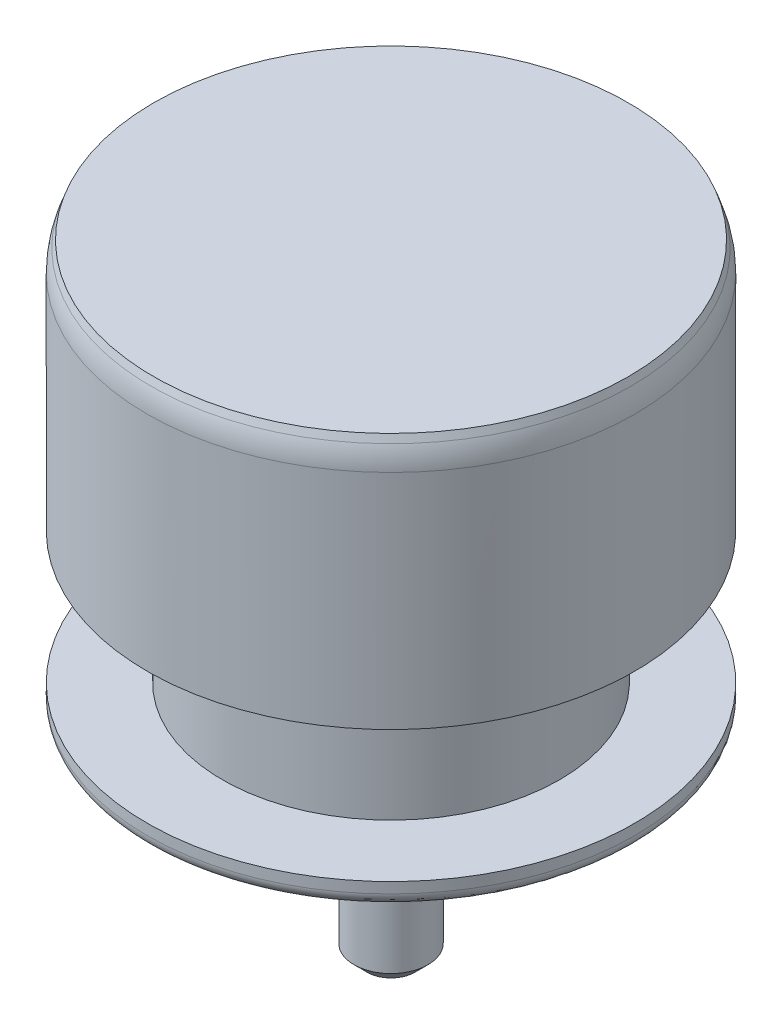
ISO-10303-21;
HEADER;
FILE_DESCRIPTION(('STEP AP214'),'2;1');
FILE_NAME('part.step','',(''),(''),'','','');
FILE_SCHEMA(('AUTOMOTIVE_DESIGN { 1 0 10303 214 1 1 1 1 }'));
ENDSEC;
DATA;
#1=APPLICATION_CONTEXT('core data for automotive mechanical design processes');
#2=APPLICATION_PROTOCOL_DEFINITION('international standard','automotive_design',2000,#1);
#3=PRODUCT_CONTEXT('',#1,'mechanical');
#4=PRODUCT('Part','Part','',(#3));
#5=PRODUCT_RELATED_PRODUCT_CATEGORY('part','',(#4));
#6=PRODUCT_DEFINITION_FORMATION('','',#4);
#7=PRODUCT_DEFINITION_CONTEXT('part definition',#1,'design');
#8=PRODUCT_DEFINITION('design','',#6,#7);
#9=PRODUCT_DEFINITION_SHAPE('','',#8);
#10=(LENGTH_UNIT() NAMED_UNIT(*) SI_UNIT(.MILLI.,.METRE.));
#11=(NAMED_UNIT(*) PLANE_ANGLE_UNIT() SI_UNIT($,.RADIAN.));
#12=(NAMED_UNIT(*) SI_UNIT($,.STERADIAN.) SOLID_ANGLE_UNIT());
#13=UNCERTAINTY_MEASURE_WITH_UNIT(LENGTH_MEASURE(1.E-05),#10,'distance_accuracy_value','');
#14=(GEOMETRIC_REPRESENTATION_CONTEXT(3) GLOBAL_UNCERTAINTY_ASSIGNED_CONTEXT((#13)) GLOBAL_UNIT_ASSIGNED_CONTEXT((#10,
#11,#12)) REPRESENTATION_CONTEXT('',''));
#15=CARTESIAN_POINT('',(0.,0.,0.));
#16=DIRECTION('',(0.,0.,1.));
#17=DIRECTION('',(1.,0.,0.));
#18=AXIS2_PLACEMENT_3D('',#15,#16,#17);
#19=CARTESIAN_POINT('',(3.66,0.,0.));
#20=DIRECTION('',(0.,-1.,0.));
#21=DIRECTION('',(1.,0.,0.));
#22=AXIS2_PLACEMENT_3D('',#19,#20,#21);
#23=PLANE('',#22);
#24=CARTESIAN_POINT('',(0.,0.,0.));
#25=DIRECTION('',(0.,1.,0.));
#26=DIRECTION('',(-1.,0.,0.));
#27=AXIS2_PLACEMENT_3D('',#24,#25,#26);
#28=CIRCLE('',#27,3.66);
#29=CARTESIAN_POINT('',(-3.66,0.,0.));
#30=VERTEX_POINT('',#29);
#31=EDGE_CURVE('E105',#30,#30,#28,.T.);
#32=ORIENTED_EDGE('',*,*,#31,.T.);
#33=EDGE_LOOP('',(#32));
#34=FACE_BOUND('',#33,.T.);
#35=ADVANCED_FACE('F64',(#34),#23,.F.);
#36=CARTESIAN_POINT('',(0.570000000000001,-9.6,0.));
#37=DIRECTION('',(0.,1.,0.));
#38=DIRECTION('',(-1.,0.,0.));
#39=AXIS2_PLACEMENT_3D('',#36,#37,#38);
#40=PLANE('',#39);
#41=CARTESIAN_POINT('',(0.,-9.6,0.));
#42=DIRECTION('',(0.,1.,0.));
#43=DIRECTION('',(-1.,0.,0.));
#44=AXIS2_PLACEMENT_3D('',#41,#42,#43);
#45=CIRCLE('',#44,0.369999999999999);
#46=CARTESIAN_POINT('',(-0.369999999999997,-9.6,0.));
#47=VERTEX_POINT('',#46);
#48=EDGE_CURVE('E11',#47,#47,#45,.F.);
#49=ORIENTED_EDGE('',*,*,#48,.T.);
#50=EDGE_LOOP('',(#49));
#51=FACE_BOUND('',#50,.T.);
#52=ADVANCED_FACE('F127',(#51),#40,.F.);
#53=CARTESIAN_POINT('',(0.,0.,0.));
#54=DIRECTION('',(0.,1.,0.));
#55=DIRECTION('',(-1.,0.,0.));
#56=AXIS2_PLACEMENT_3D('',#53,#54,#55);
#57=CYLINDRICAL_SURFACE('',#56,0.57);
#58=CARTESIAN_POINT('',(0.,-9.4,0.));
#59=DIRECTION('',(0.,1.,0.));
#60=DIRECTION('',(-1.,0.,0.));
#61=AXIS2_PLACEMENT_3D('',#58,#59,#60);
#62=CIRCLE('',#61,0.57);
#63=CARTESIAN_POINT('',(-0.569999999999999,-9.4,0.));
#64=VERTEX_POINT('',#63);
#65=EDGE_CURVE('E71',#64,#64,#62,.T.);
#66=ORIENTED_EDGE('',*,*,#65,.T.);
#67=EDGE_LOOP('',(#66));
#68=FACE_BOUND('',#67,.T.);
#69=CARTESIAN_POINT('',(0.,-7.89692562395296,0.));
#70=DIRECTION('',(0.,1.,0.));
#71=DIRECTION('',(-1.,0.,0.));
#72=AXIS2_PLACEMENT_3D('',#69,#70,#71);
#73=CIRCLE('',#72,0.57);
#74=CARTESIAN_POINT('',(-0.569999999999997,-7.89692562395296,0.));
#75=VERTEX_POINT('',#74);
#76=EDGE_CURVE('E90',#75,#75,#73,.T.);
#77=ORIENTED_EDGE('',*,*,#76,.F.);
#78=EDGE_LOOP('',(#77));
#79=FACE_BOUND('',#78,.T.);
#80=ADVANCED_FACE('F132',(#68,#79),#57,.T.);
#81=CARTESIAN_POINT('',(0.,-7.89692562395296,0.));
#82=DIRECTION('',(0.,1.,0.));
#83=DIRECTION('',(-1.,0.,0.));
#84=AXIS2_PLACEMENT_3D('',#81,#82,#83);
#85=CONICAL_SURFACE('',#84,0.57,1.08210413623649);
#86=CARTESIAN_POINT('',(0.,-6.25718993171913,0.));
#87=DIRECTION('',(0.,-1.,0.));
#88=DIRECTION('',(1.,0.,0.));
#89=AXIS2_PLACEMENT_3D('',#86,#87,#88);
#90=CIRCLE('',#89,3.65389431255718);
#91=CARTESIAN_POINT('',(-3.65389431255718,-6.25718993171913,0.));
#92=VERTEX_POINT('',#91);
#93=EDGE_CURVE('E84',#92,#92,#90,.T.);
#94=CARTESIAN_POINT('',(-3.65389431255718,-6.25718993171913,0.));
#95=CARTESIAN_POINT('',(-3.62177041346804,-6.27427051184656,0.));
#96=CARTESIAN_POINT('',(-3.5896465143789,-6.291351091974,0.));
#97=CARTESIAN_POINT('',(-3.52539871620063,-6.32551225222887,0.));
#98=CARTESIAN_POINT('',(-3.49327481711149,-6.34259283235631,0.));
#99=CARTESIAN_POINT('',(-3.42902701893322,-6.37675399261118,0.));
#100=CARTESIAN_POINT('',(-3.39690311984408,-6.39383457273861,0.));
#101=CARTESIAN_POINT('',(-3.3326553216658,-6.42799573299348,0.));
#102=CARTESIAN_POINT('',(-3.30053142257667,-6.44507631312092,0.));
#103=CARTESIAN_POINT('',(-3.23628362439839,-6.47923747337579,0.));
#104=CARTESIAN_POINT('',(-3.20415972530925,-6.49631805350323,0.));
#105=CARTESIAN_POINT('',(-3.13991192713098,-6.5304792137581,0.));
#106=CARTESIAN_POINT('',(-3.10778802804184,-6.54755979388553,0.));
#107=CARTESIAN_POINT('',(-3.04354022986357,-6.58172095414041,0.));
#108=CARTESIAN_POINT('',(-3.01141633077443,-6.59880153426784,0.));
#109=CARTESIAN_POINT('',(-2.94716853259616,-6.63296269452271,0.));
#110=CARTESIAN_POINT('',(-2.91504463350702,-6.65004327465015,0.));
#111=CARTESIAN_POINT('',(-2.85079683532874,-6.68420443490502,0.));
#112=CARTESIAN_POINT('',(-2.81867293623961,-6.70128501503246,0.));
#113=CARTESIAN_POINT('',(-2.75442513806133,-6.73544617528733,0.));
#114=CARTESIAN_POINT('',(-2.72230123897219,-6.75252675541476,0.));
#115=CARTESIAN_POINT('',(-2.65805344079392,-6.78668791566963,0.));
#116=CARTESIAN_POINT('',(-2.62592954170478,-6.80376849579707,0.));
#117=CARTESIAN_POINT('',(-2.56168174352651,-6.83792965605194,0.));
#118=CARTESIAN_POINT('',(-2.52955784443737,-6.85501023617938,0.));
#119=CARTESIAN_POINT('',(-2.4653100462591,-6.88917139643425,0.));
#120=CARTESIAN_POINT('',(-2.43318614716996,-6.90625197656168,0.));
#121=CARTESIAN_POINT('',(-2.36893834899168,-6.94041313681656,0.));
#122=CARTESIAN_POINT('',(-2.33681444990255,-6.95749371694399,0.));
#123=CARTESIAN_POINT('',(-2.27256665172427,-6.99165487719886,0.));
#124=CARTESIAN_POINT('',(-2.24044275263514,-7.0087354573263,0.));
#125=CARTESIAN_POINT('',(-2.17619495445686,-7.04289661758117,0.));
#126=CARTESIAN_POINT('',(-2.14407105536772,-7.05997719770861,0.));
#127=CARTESIAN_POINT('',(-2.07982325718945,-7.09413835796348,0.));
#128=CARTESIAN_POINT('',(-2.04769935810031,-7.11121893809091,0.));
#129=CARTESIAN_POINT('',(-1.98345155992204,-7.14538009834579,0.));
#130=CARTESIAN_POINT('',(-1.9513276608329,-7.16246067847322,0.));
#131=CARTESIAN_POINT('',(-1.88707986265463,-7.19662183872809,0.));
#132=CARTESIAN_POINT('',(-1.85495596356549,-7.21370241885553,0.));
#133=CARTESIAN_POINT('',(-1.79070816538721,-7.2478635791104,0.));
#134=CARTESIAN_POINT('',(-1.75858426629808,-7.26494415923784,0.));
#135=CARTESIAN_POINT('',(-1.6943364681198,-7.29910531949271,0.));
#136=CARTESIAN_POINT('',(-1.66221256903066,-7.31618589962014,0.));
#137=CARTESIAN_POINT('',(-1.59796477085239,-7.35034705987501,0.));
#138=CARTESIAN_POINT('',(-1.56584087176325,-7.36742764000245,0.));
#139=CARTESIAN_POINT('',(-1.50159307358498,-7.40158880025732,0.));
#140=CARTESIAN_POINT('',(-1.46946917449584,-7.41866938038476,0.));
#141=CARTESIAN_POINT('',(-1.40522137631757,-7.45283054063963,0.));
#142=CARTESIAN_POINT('',(-1.37309747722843,-7.46991112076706,0.));
#143=CARTESIAN_POINT('',(-1.30884967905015,-7.50407228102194,0.));
#144=CARTESIAN_POINT('',(-1.27672577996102,-7.52115286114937,0.));
#145=CARTESIAN_POINT('',(-1.21247798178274,-7.55531402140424,0.));
#146=CARTESIAN_POINT('',(-1.18035408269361,-7.57239460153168,0.));
#147=CARTESIAN_POINT('',(-1.11610628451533,-7.60655576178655,0.));
#148=CARTESIAN_POINT('',(-1.08398238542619,-7.62363634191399,0.));
#149=CARTESIAN_POINT('',(-1.01973458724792,-7.65779750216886,0.));
#150=CARTESIAN_POINT('',(-0.987610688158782,-7.67487808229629,0.));
#151=CARTESIAN_POINT('',(-0.923362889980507,-7.70903924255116,0.));
#152=CARTESIAN_POINT('',(-0.89123899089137,-7.7261198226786,0.));
#153=CARTESIAN_POINT('',(-0.826991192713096,-7.76028098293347,0.));
#154=CARTESIAN_POINT('',(-0.794867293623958,-7.77736156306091,0.));
#155=CARTESIAN_POINT('',(-0.730619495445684,-7.81152272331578,0.));
#156=CARTESIAN_POINT('',(-0.698495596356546,-7.82860330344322,0.));
#157=CARTESIAN_POINT('',(-0.634247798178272,-7.86276446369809,0.));
#158=CARTESIAN_POINT('',(-0.602123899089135,-7.87984504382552,0.));
#159=CARTESIAN_POINT('',(-0.569999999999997,-7.89692562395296,0.));
#160=B_SPLINE_CURVE_WITH_KNOTS('',3,(#94,#95,#96,#97,#98,#99,#100,#101,#102,#103,#104,#105,#106,
#107,#108,#109,#110,#111,#112,#113,#114,#115,#116,#117,#118,#119,#120,#121,#122,#123,#124,#125,
#126,#127,#128,#129,#130,#131,#132,#133,#134,#135,#136,#137,#138,#139,#140,#141,#142,#143,#144,
#145,#146,#147,#148,#149,#150,#151,#152,#153,#154,#155,#156,#157,#158,#159),.UNSPECIFIED.,.F.,
.F.,(4,2,2,2,2,2,2,2,2,2,2,2,2,2,2,2,2,2,2,2,2,2,2,2,2,2,2,2,2,2,2,2,4),(0.,0.109147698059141,
0.218295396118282,0.327443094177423,0.436590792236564,0.545738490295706,0.654886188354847,
0.764033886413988,0.87318158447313,0.982329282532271,1.09147698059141,1.20062467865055,
1.30977237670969,1.41892007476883,1.52806777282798,1.63721547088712,1.74636316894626,
1.8555108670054,1.96465856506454,2.07380626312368,2.18295396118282,2.29210165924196,
2.40124935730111,2.51039705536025,2.61954475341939,2.72869245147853,2.83784014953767,
2.94698784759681,3.05613554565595,3.16528324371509,3.27443094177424,3.38357863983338,
3.49272633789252),.UNSPECIFIED.);
#161=EDGE_CURVE('BSEAM166',#92,#75,#160,.T.);
#162=ORIENTED_EDGE('',*,*,#93,.T.);
#163=ORIENTED_EDGE('',*,*,#76,.T.);
#164=ORIENTED_EDGE('',*,*,#161,.T.);
#165=ORIENTED_EDGE('',*,*,#161,.F.);
#166=EDGE_LOOP('',(#162,#164,#163,#165));
#167=FACE_BOUND('',#166,.T.);
#168=ADVANCED_FACE('F166',(#167),#85,.T.);
#169=CARTESIAN_POINT('',(0.,0.,0.));
#170=DIRECTION('',(0.,1.,0.));
#171=DIRECTION('',(-1.,0.,0.));
#172=AXIS2_PLACEMENT_3D('',#169,#170,#171);
#173=CYLINDRICAL_SURFACE('',#172,3.76);
#174=CARTESIAN_POINT('',(0.,-6.08060041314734,0.));
#175=DIRECTION('',(0.,-1.,0.));
#176=DIRECTION('',(1.,0.,0.));
#177=AXIS2_PLACEMENT_3D('',#174,#175,#176);
#178=CIRCLE('',#177,3.76);
#179=CARTESIAN_POINT('',(3.76,-6.08060041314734,0.));
#180=VERTEX_POINT('',#179);
#181=EDGE_CURVE('E87',#180,#180,#178,.F.);
#182=ORIENTED_EDGE('',*,*,#181,.T.);
#183=EDGE_LOOP('',(#182));
#184=FACE_BOUND('',#183,.T.);
#185=CARTESIAN_POINT('',(0.,-5.915,0.));
#186=DIRECTION('',(0.,1.,0.));
#187=DIRECTION('',(-1.,0.,0.));
#188=AXIS2_PLACEMENT_3D('',#185,#186,#187);
#189=CIRCLE('',#188,3.76);
#190=CARTESIAN_POINT('',(-3.76,-5.915,0.));
#191=VERTEX_POINT('',#190);
#192=EDGE_CURVE('E93',#191,#191,#189,.T.);
#193=ORIENTED_EDGE('',*,*,#192,.F.);
#194=EDGE_LOOP('',(#193));
#195=FACE_BOUND('',#194,.T.);
#196=ADVANCED_FACE('F161',(#184,#195),#173,.T.);
#197=CARTESIAN_POINT('',(3.76,-5.915,0.));
#198=DIRECTION('',(0.,-1.,0.));
#199=DIRECTION('',(1.,0.,0.));
#200=AXIS2_PLACEMENT_3D('',#197,#198,#199);
#201=PLANE('',#200);
#202=CARTESIAN_POINT('',(0.,-5.915,0.));
#203=DIRECTION('',(0.,1.,0.));
#204=DIRECTION('',(-1.,0.,0.));
#205=AXIS2_PLACEMENT_3D('',#202,#203,#204);
#206=CIRCLE('',#205,2.6);
#207=CARTESIAN_POINT('',(-2.6,-5.915,0.));
#208=VERTEX_POINT('',#207);
#209=EDGE_CURVE('E96',#208,#208,#206,.T.);
#210=ORIENTED_EDGE('',*,*,#209,.F.);
#211=EDGE_LOOP('',(#210));
#212=FACE_BOUND('',#211,.T.);
#213=ORIENTED_EDGE('',*,*,#192,.T.);
#214=EDGE_LOOP('',(#213));
#215=FACE_BOUND('',#214,.T.);
#216=ADVANCED_FACE('F155',(#212,#215),#201,.F.);
#217=CARTESIAN_POINT('',(0.,0.,0.));
#218=DIRECTION('',(0.,1.,0.));
#219=DIRECTION('',(-1.,0.,0.));
#220=AXIS2_PLACEMENT_3D('',#217,#218,#219);
#221=CYLINDRICAL_SURFACE('',#220,2.6);
#222=CARTESIAN_POINT('',(0.,-3.885,0.));
#223=DIRECTION('',(0.,1.,0.));
#224=DIRECTION('',(-1.,0.,0.));
#225=AXIS2_PLACEMENT_3D('',#222,#223,#224);
#226=CIRCLE('',#225,2.6);
#227=CARTESIAN_POINT('',(-2.6,-3.885,0.));
#228=VERTEX_POINT('',#227);
#229=EDGE_CURVE('E99',#228,#228,#226,.T.);
#230=ORIENTED_EDGE('',*,*,#229,.F.);
#231=EDGE_LOOP('',(#230));
#232=FACE_BOUND('',#231,.T.);
#233=ORIENTED_EDGE('',*,*,#209,.T.);
#234=EDGE_LOOP('',(#233));
#235=FACE_BOUND('',#234,.T.);
#236=ADVANCED_FACE('F149',(#232,#235),#221,.T.);
#237=CARTESIAN_POINT('',(2.6,-3.885,0.));
#238=DIRECTION('',(0.,1.,0.));
#239=DIRECTION('',(-1.,0.,0.));
#240=AXIS2_PLACEMENT_3D('',#237,#238,#239);
#241=PLANE('',#240);
#242=CARTESIAN_POINT('',(0.,-3.885,0.));
#243=DIRECTION('',(0.,1.,0.));
#244=DIRECTION('',(-1.,0.,0.));
#245=AXIS2_PLACEMENT_3D('',#242,#243,#244);
#246=CIRCLE('',#245,3.76);
#247=CARTESIAN_POINT('',(-3.76,-3.885,0.));
#248=VERTEX_POINT('',#247);
#249=EDGE_CURVE('E102',#248,#248,#246,.T.);
#250=ORIENTED_EDGE('',*,*,#249,.F.);
#251=EDGE_LOOP('',(#250));
#252=FACE_BOUND('',#251,.T.);
#253=ORIENTED_EDGE('',*,*,#229,.T.);
#254=EDGE_LOOP('',(#253));
#255=FACE_BOUND('',#254,.T.);
#256=ADVANCED_FACE('F123',(#252,#255),#241,.F.);
#257=CARTESIAN_POINT('',(0.,0.,0.));
#258=DIRECTION('',(0.,1.,0.));
#259=DIRECTION('',(-1.,0.,0.));
#260=AXIS2_PLACEMENT_3D('',#257,#258,#259);
#261=CYLINDRICAL_SURFACE('',#260,3.76);
#262=CARTESIAN_POINT('',(0.,-0.451074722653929,0.));
#263=DIRECTION('',(0.,-1.,0.));
#264=DIRECTION('',(1.,0.,0.));
#265=AXIS2_PLACEMENT_3D('',#262,#263,#264);
#266=CIRCLE('',#265,3.76);
#267=CARTESIAN_POINT('',(3.76,-0.451074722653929,0.));
#268=VERTEX_POINT('',#267);
#269=EDGE_CURVE('E75',#268,#268,#266,.T.);
#270=ORIENTED_EDGE('',*,*,#269,.T.);
#271=EDGE_LOOP('',(#270));
#272=FACE_BOUND('',#271,.T.);
#273=ORIENTED_EDGE('',*,*,#249,.T.);
#274=EDGE_LOOP('',(#273));
#275=FACE_BOUND('',#274,.T.);
#276=ADVANCED_FACE('F113',(#272,#275),#261,.T.);
#277=CARTESIAN_POINT('',(0.,-0.274747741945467,0.));
#278=DIRECTION('',(0.,-1.,0.));
#279=DIRECTION('',(1.,0.,0.));
#280=AXIS2_PLACEMENT_3D('',#277,#278,#279);
#281=CONICAL_SURFACE('',#280,3.76,0.34906585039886);
#282=CARTESIAN_POINT('',(0.,-0.109054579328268,0.));
#283=DIRECTION('',(0.,1.,0.));
#284=DIRECTION('',(-1.,0.,0.));
#285=AXIS2_PLACEMENT_3D('',#282,#283,#284);
#286=CIRCLE('',#285,3.69969262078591);
#287=CARTESIAN_POINT('',(-3.69969262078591,-0.109054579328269,0.));
#288=VERTEX_POINT('',#287);
#289=EDGE_CURVE('E79',#288,#288,#286,.T.);
#290=ORIENTED_EDGE('',*,*,#289,.T.);
#291=EDGE_LOOP('',(#290));
#292=FACE_BOUND('',#291,.T.);
#293=ORIENTED_EDGE('',*,*,#31,.F.);
#294=EDGE_LOOP('',(#293));
#295=FACE_BOUND('',#294,.T.);
#296=ADVANCED_FACE('F110',(#292,#295),#281,.T.);
#297=CARTESIAN_POINT('',(0.,-6.08060041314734,0.));
#298=DIRECTION('',(0.,-1.,0.));
#299=DIRECTION('',(1.,0.,0.));
#300=AXIS2_PLACEMENT_3D('',#297,#298,#299);
#301=TOROIDAL_SURFACE('',#300,3.56,0.2);
#302=ORIENTED_EDGE('',*,*,#93,.F.);
#303=EDGE_LOOP('',(#302));
#304=FACE_BOUND('',#303,.T.);
#305=ORIENTED_EDGE('',*,*,#181,.F.);
#306=EDGE_LOOP('',(#305));
#307=FACE_BOUND('',#306,.T.);
#308=ADVANCED_FACE('F112',(#304,#307),#301,.T.);
#309=CARTESIAN_POINT('',(0.,-0.451074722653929,0.));
#310=DIRECTION('',(0.,-1.,0.));
#311=DIRECTION('',(1.,0.,0.));
#312=AXIS2_PLACEMENT_3D('',#309,#310,#311);
#313=TOROIDAL_SURFACE('',#312,2.76,1.);
#314=ORIENTED_EDGE('',*,*,#269,.F.);
#315=EDGE_LOOP('',(#314));
#316=FACE_BOUND('',#315,.T.);
#317=ORIENTED_EDGE('',*,*,#289,.F.);
#318=EDGE_LOOP('',(#317));
#319=FACE_BOUND('',#318,.T.);
#320=ADVANCED_FACE('F120',(#316,#319),#313,.T.);
#321=CARTESIAN_POINT('',(0.,-9.4,0.));
#322=DIRECTION('',(0.,1.,0.));
#323=DIRECTION('',(-1.,0.,0.));
#324=AXIS2_PLACEMENT_3D('',#321,#322,#323);
#325=CONICAL_SURFACE('',#324,0.57,0.785398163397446);
#326=ORIENTED_EDGE('',*,*,#48,.F.);
#327=EDGE_LOOP('',(#326));
#328=FACE_BOUND('',#327,.T.);
#329=ORIENTED_EDGE('',*,*,#65,.F.);
#330=EDGE_LOOP('',(#329));
#331=FACE_BOUND('',#330,.T.);
#332=ADVANCED_FACE('F66',(#328,#331),#325,.T.);
#333=CLOSED_SHELL('',(#35,#52,#80,#168,#196,#216,#236,#256,#276,#296,#308,#320,#332));
#334=MANIFOLD_SOLID_BREP('B2',#333);
#335=ADVANCED_BREP_SHAPE_REPRESENTATION('',(#18,#334),#14);
#336=SHAPE_DEFINITION_REPRESENTATION(#9,#335);
ENDSEC;
END-ISO-10303-21;
